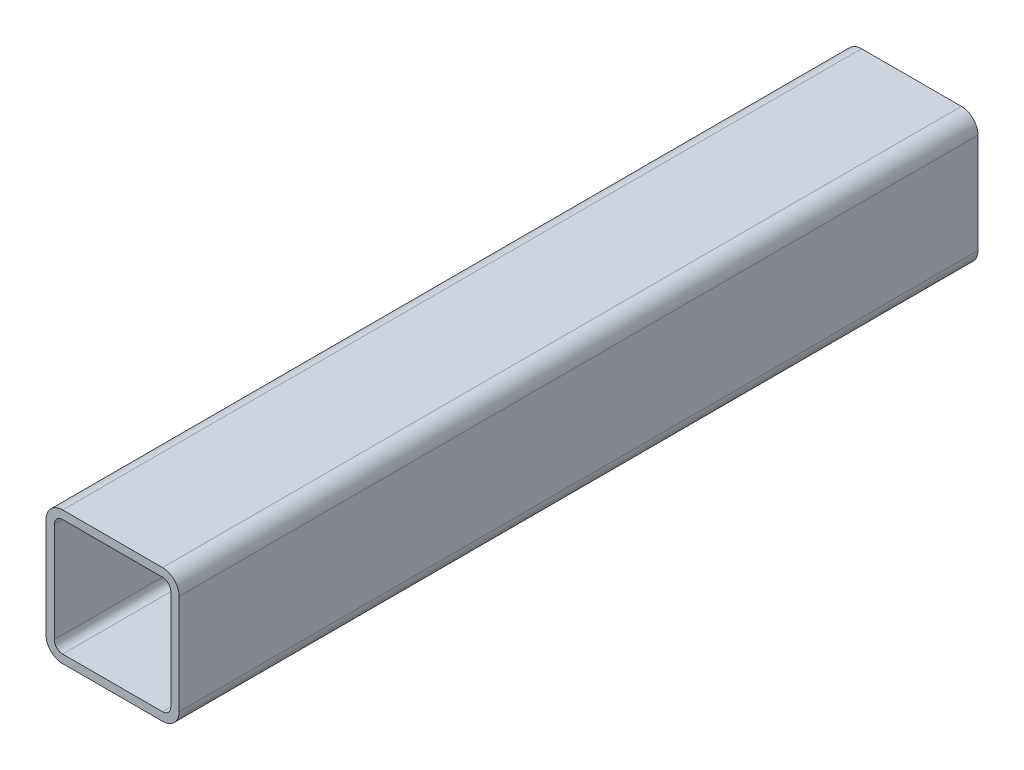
ISO-10303-21;
HEADER;
FILE_DESCRIPTION(('STEP AP214'),'2;1');
FILE_NAME('part.step','',(''),(''),'','','');
FILE_SCHEMA(('AUTOMOTIVE_DESIGN { 1 0 10303 214 1 1 1 1 }'));
ENDSEC;
DATA;
#1=APPLICATION_CONTEXT('core data for automotive mechanical design processes');
#2=APPLICATION_PROTOCOL_DEFINITION('international standard','automotive_design',2000,#1);
#3=PRODUCT_CONTEXT('',#1,'mechanical');
#4=PRODUCT('Part','Part','',(#3));
#5=PRODUCT_RELATED_PRODUCT_CATEGORY('part','',(#4));
#6=PRODUCT_DEFINITION_FORMATION('','',#4);
#7=PRODUCT_DEFINITION_CONTEXT('part definition',#1,'design');
#8=PRODUCT_DEFINITION('design','',#6,#7);
#9=PRODUCT_DEFINITION_SHAPE('','',#8);
#10=(LENGTH_UNIT() NAMED_UNIT(*) SI_UNIT(.MILLI.,.METRE.));
#11=(NAMED_UNIT(*) PLANE_ANGLE_UNIT() SI_UNIT($,.RADIAN.));
#12=(NAMED_UNIT(*) SI_UNIT($,.STERADIAN.) SOLID_ANGLE_UNIT());
#13=UNCERTAINTY_MEASURE_WITH_UNIT(LENGTH_MEASURE(1.E-05),#10,'distance_accuracy_value','');
#14=(GEOMETRIC_REPRESENTATION_CONTEXT(3) GLOBAL_UNCERTAINTY_ASSIGNED_CONTEXT((#13)) GLOBAL_UNIT_ASSIGNED_CONTEXT((#10,
#11,#12)) REPRESENTATION_CONTEXT('',''));
#15=CARTESIAN_POINT('',(0.,0.,0.));
#16=DIRECTION('',(0.,0.,1.));
#17=DIRECTION('',(1.,0.,0.));
#18=AXIS2_PLACEMENT_3D('',#15,#16,#17);
#19=CARTESIAN_POINT('',(6.34999999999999,44.45,304.8));
#20=DIRECTION('',(0.,0.,1.));
#21=DIRECTION('',(1.,0.,0.));
#22=AXIS2_PLACEMENT_3D('',#19,#20,#21);
#23=PLANE('',#22);
#24=CARTESIAN_POINT('',(6.34999999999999,44.45,304.8));
#25=DIRECTION('',(0.,0.,1.));
#26=DIRECTION('',(1.,0.,0.));
#27=AXIS2_PLACEMENT_3D('',#24,#25,#26);
#28=CIRCLE('',#27,6.35);
#29=CARTESIAN_POINT('',(6.35,50.8,304.8));
#30=VERTEX_POINT('',#29);
#31=CARTESIAN_POINT('',(0.,44.45,304.8));
#32=VERTEX_POINT('',#31);
#33=EDGE_CURVE('E211',#30,#32,#28,.T.);
#34=ORIENTED_EDGE('',*,*,#33,.T.);
#35=DIRECTION('',(0.,-1.,0.));
#36=VECTOR('',#35,1.);
#37=CARTESIAN_POINT('',(0.,6.35,304.8));
#38=LINE('',#37,#36);
#39=CARTESIAN_POINT('',(0.,6.35,304.8));
#40=VERTEX_POINT('',#39);
#41=EDGE_CURVE('E214',#32,#40,#38,.T.);
#42=ORIENTED_EDGE('',*,*,#41,.T.);
#43=CARTESIAN_POINT('',(6.35,6.35,304.8));
#44=DIRECTION('',(0.,0.,1.));
#45=DIRECTION('',(1.,0.,0.));
#46=AXIS2_PLACEMENT_3D('',#43,#44,#45);
#47=CIRCLE('',#46,6.35);
#48=CARTESIAN_POINT('',(6.35,0.,304.8));
#49=VERTEX_POINT('',#48);
#50=EDGE_CURVE('E217',#40,#49,#47,.T.);
#51=ORIENTED_EDGE('',*,*,#50,.T.);
#52=DIRECTION('',(1.,0.,0.));
#53=VECTOR('',#52,1.);
#54=CARTESIAN_POINT('',(44.45,0.,304.8));
#55=LINE('',#54,#53);
#56=CARTESIAN_POINT('',(44.45,0.,304.8));
#57=VERTEX_POINT('',#56);
#58=EDGE_CURVE('E219',#49,#57,#55,.T.);
#59=ORIENTED_EDGE('',*,*,#58,.T.);
#60=CARTESIAN_POINT('',(44.45,6.34999999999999,304.8));
#61=DIRECTION('',(0.,0.,1.));
#62=DIRECTION('',(1.,0.,0.));
#63=AXIS2_PLACEMENT_3D('',#60,#61,#62);
#64=CIRCLE('',#63,6.35);
#65=CARTESIAN_POINT('',(50.8,6.35,304.8));
#66=VERTEX_POINT('',#65);
#67=EDGE_CURVE('E221',#57,#66,#64,.T.);
#68=ORIENTED_EDGE('',*,*,#67,.T.);
#69=DIRECTION('',(0.,1.,0.));
#70=VECTOR('',#69,1.);
#71=CARTESIAN_POINT('',(50.8,44.45,304.8));
#72=LINE('',#71,#70);
#73=CARTESIAN_POINT('',(50.8,44.45,304.8));
#74=VERTEX_POINT('',#73);
#75=EDGE_CURVE('E223',#66,#74,#72,.T.);
#76=ORIENTED_EDGE('',*,*,#75,.T.);
#77=CARTESIAN_POINT('',(44.45,44.45,304.8));
#78=DIRECTION('',(0.,0.,1.));
#79=DIRECTION('',(1.,0.,0.));
#80=AXIS2_PLACEMENT_3D('',#77,#78,#79);
#81=CIRCLE('',#80,6.35);
#82=CARTESIAN_POINT('',(44.45,50.8,304.8));
#83=VERTEX_POINT('',#82);
#84=EDGE_CURVE('E225',#74,#83,#81,.T.);
#85=ORIENTED_EDGE('',*,*,#84,.T.);
#86=DIRECTION('',(-1.,0.,0.));
#87=VECTOR('',#86,1.);
#88=CARTESIAN_POINT('',(6.35,50.8,304.8));
#89=LINE('',#88,#87);
#90=EDGE_CURVE('E227',#83,#30,#89,.T.);
#91=ORIENTED_EDGE('',*,*,#90,.T.);
#92=EDGE_LOOP('',(#34,#42,#51,#59,#68,#76,#85,#91));
#93=FACE_BOUND('',#92,.T.);
#94=DIRECTION('',(0.,-1.,0.));
#95=VECTOR('',#94,1.);
#96=CARTESIAN_POINT('',(3.175,6.35,304.8));
#97=LINE('',#96,#95);
#98=CARTESIAN_POINT('',(3.175,44.45,304.8));
#99=VERTEX_POINT('',#98);
#100=CARTESIAN_POINT('',(3.175,6.35,304.8));
#101=VERTEX_POINT('',#100);
#102=EDGE_CURVE('E154',#99,#101,#97,.T.);
#103=ORIENTED_EDGE('',*,*,#102,.F.);
#104=CARTESIAN_POINT('',(6.34999999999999,44.45,304.8));
#105=DIRECTION('',(0.,0.,1.));
#106=DIRECTION('',(1.,0.,0.));
#107=AXIS2_PLACEMENT_3D('',#104,#105,#106);
#108=CIRCLE('',#107,3.175);
#109=CARTESIAN_POINT('',(6.35,47.625,304.8));
#110=VERTEX_POINT('',#109);
#111=EDGE_CURVE('E146',#110,#99,#108,.T.);
#112=ORIENTED_EDGE('',*,*,#111,.F.);
#113=DIRECTION('',(-1.,0.,0.));
#114=VECTOR('',#113,1.);
#115=CARTESIAN_POINT('',(6.35,47.625,304.8));
#116=LINE('',#115,#114);
#117=CARTESIAN_POINT('',(44.45,47.625,304.8));
#118=VERTEX_POINT('',#117);
#119=EDGE_CURVE('E179',#118,#110,#116,.T.);
#120=ORIENTED_EDGE('',*,*,#119,.F.);
#121=CARTESIAN_POINT('',(44.45,44.45,304.8));
#122=DIRECTION('',(0.,0.,1.));
#123=DIRECTION('',(1.,0.,0.));
#124=AXIS2_PLACEMENT_3D('',#121,#122,#123);
#125=CIRCLE('',#124,3.175);
#126=CARTESIAN_POINT('',(47.625,44.45,304.8));
#127=VERTEX_POINT('',#126);
#128=EDGE_CURVE('E177',#127,#118,#125,.T.);
#129=ORIENTED_EDGE('',*,*,#128,.F.);
#130=DIRECTION('',(0.,1.,0.));
#131=VECTOR('',#130,1.);
#132=CARTESIAN_POINT('',(47.625,44.45,304.8));
#133=LINE('',#132,#131);
#134=CARTESIAN_POINT('',(47.625,6.35,304.8));
#135=VERTEX_POINT('',#134);
#136=EDGE_CURVE('E175',#135,#127,#133,.T.);
#137=ORIENTED_EDGE('',*,*,#136,.F.);
#138=CARTESIAN_POINT('',(44.45,6.34999999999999,304.8));
#139=DIRECTION('',(0.,0.,1.));
#140=DIRECTION('',(1.,0.,0.));
#141=AXIS2_PLACEMENT_3D('',#138,#139,#140);
#142=CIRCLE('',#141,3.175);
#143=CARTESIAN_POINT('',(44.45,3.175,304.8));
#144=VERTEX_POINT('',#143);
#145=EDGE_CURVE('E173',#144,#135,#142,.T.);
#146=ORIENTED_EDGE('',*,*,#145,.F.);
#147=DIRECTION('',(1.,0.,0.));
#148=VECTOR('',#147,1.);
#149=CARTESIAN_POINT('',(44.45,3.175,304.8));
#150=LINE('',#149,#148);
#151=CARTESIAN_POINT('',(6.35,3.175,304.8));
#152=VERTEX_POINT('',#151);
#153=EDGE_CURVE('E169',#152,#144,#150,.T.);
#154=ORIENTED_EDGE('',*,*,#153,.F.);
#155=CARTESIAN_POINT('',(6.35,6.35,304.8));
#156=DIRECTION('',(0.,0.,1.));
#157=DIRECTION('',(1.,0.,0.));
#158=AXIS2_PLACEMENT_3D('',#155,#156,#157);
#159=CIRCLE('',#158,3.175);
#160=EDGE_CURVE('E167',#101,#152,#159,.T.);
#161=ORIENTED_EDGE('',*,*,#160,.F.);
#162=EDGE_LOOP('',(#103,#112,#120,#129,#137,#146,#154,#161));
#163=FACE_BOUND('',#162,.T.);
#164=ADVANCED_FACE('F33',(#93,#163),#23,.T.);
#165=CARTESIAN_POINT('',(6.34999999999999,44.45,0.));
#166=DIRECTION('',(0.,0.,1.));
#167=DIRECTION('',(1.,0.,0.));
#168=AXIS2_PLACEMENT_3D('',#165,#166,#167);
#169=PLANE('',#168);
#170=CARTESIAN_POINT('',(6.34999999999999,44.45,0.));
#171=DIRECTION('',(0.,0.,1.));
#172=DIRECTION('',(1.,0.,0.));
#173=AXIS2_PLACEMENT_3D('',#170,#171,#172);
#174=CIRCLE('',#173,6.35);
#175=CARTESIAN_POINT('',(6.35,50.8,0.));
#176=VERTEX_POINT('',#175);
#177=CARTESIAN_POINT('',(0.,44.45,0.));
#178=VERTEX_POINT('',#177);
#179=EDGE_CURVE('E162',#176,#178,#174,.T.);
#180=ORIENTED_EDGE('',*,*,#179,.F.);
#181=DIRECTION('',(-1.,0.,0.));
#182=VECTOR('',#181,1.);
#183=CARTESIAN_POINT('',(6.35,50.8,0.));
#184=LINE('',#183,#182);
#185=CARTESIAN_POINT('',(44.45,50.8,0.));
#186=VERTEX_POINT('',#185);
#187=EDGE_CURVE('E215',#186,#176,#184,.T.);
#188=ORIENTED_EDGE('',*,*,#187,.F.);
#189=CARTESIAN_POINT('',(44.45,44.45,0.));
#190=DIRECTION('',(0.,0.,1.));
#191=DIRECTION('',(1.,0.,0.));
#192=AXIS2_PLACEMENT_3D('',#189,#190,#191);
#193=CIRCLE('',#192,6.35);
#194=CARTESIAN_POINT('',(50.8,44.45,0.));
#195=VERTEX_POINT('',#194);
#196=EDGE_CURVE('E242',#195,#186,#193,.T.);
#197=ORIENTED_EDGE('',*,*,#196,.F.);
#198=DIRECTION('',(0.,1.,0.));
#199=VECTOR('',#198,1.);
#200=CARTESIAN_POINT('',(50.8,44.45,0.));
#201=LINE('',#200,#199);
#202=CARTESIAN_POINT('',(50.8,6.35,0.));
#203=VERTEX_POINT('',#202);
#204=EDGE_CURVE('E240',#203,#195,#201,.T.);
#205=ORIENTED_EDGE('',*,*,#204,.F.);
#206=CARTESIAN_POINT('',(44.45,6.34999999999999,0.));
#207=DIRECTION('',(0.,0.,1.));
#208=DIRECTION('',(1.,0.,0.));
#209=AXIS2_PLACEMENT_3D('',#206,#207,#208);
#210=CIRCLE('',#209,6.35);
#211=CARTESIAN_POINT('',(44.45,0.,0.));
#212=VERTEX_POINT('',#211);
#213=EDGE_CURVE('E238',#212,#203,#210,.T.);
#214=ORIENTED_EDGE('',*,*,#213,.F.);
#215=DIRECTION('',(1.,0.,0.));
#216=VECTOR('',#215,1.);
#217=CARTESIAN_POINT('',(44.45,0.,0.));
#218=LINE('',#217,#216);
#219=CARTESIAN_POINT('',(6.35,0.,0.));
#220=VERTEX_POINT('',#219);
#221=EDGE_CURVE('E236',#220,#212,#218,.T.);
#222=ORIENTED_EDGE('',*,*,#221,.F.);
#223=CARTESIAN_POINT('',(6.35,6.35,0.));
#224=DIRECTION('',(0.,0.,1.));
#225=DIRECTION('',(1.,0.,0.));
#226=AXIS2_PLACEMENT_3D('',#223,#224,#225);
#227=CIRCLE('',#226,6.35);
#228=CARTESIAN_POINT('',(0.,6.35,0.));
#229=VERTEX_POINT('',#228);
#230=EDGE_CURVE('E234',#229,#220,#227,.T.);
#231=ORIENTED_EDGE('',*,*,#230,.F.);
#232=DIRECTION('',(0.,-1.,0.));
#233=VECTOR('',#232,1.);
#234=CARTESIAN_POINT('',(0.,6.35,0.));
#235=LINE('',#234,#233);
#236=EDGE_CURVE('E232',#178,#229,#235,.T.);
#237=ORIENTED_EDGE('',*,*,#236,.F.);
#238=EDGE_LOOP('',(#180,#188,#197,#205,#214,#222,#231,#237));
#239=FACE_BOUND('',#238,.T.);
#240=CARTESIAN_POINT('',(6.34999999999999,44.45,0.));
#241=DIRECTION('',(0.,0.,1.));
#242=DIRECTION('',(1.,0.,0.));
#243=AXIS2_PLACEMENT_3D('',#240,#241,#242);
#244=CIRCLE('',#243,3.175);
#245=CARTESIAN_POINT('',(6.35,47.625,0.));
#246=VERTEX_POINT('',#245);
#247=CARTESIAN_POINT('',(3.175,44.45,0.));
#248=VERTEX_POINT('',#247);
#249=EDGE_CURVE('E56',#246,#248,#244,.T.);
#250=ORIENTED_EDGE('',*,*,#249,.T.);
#251=DIRECTION('',(0.,-1.,0.));
#252=VECTOR('',#251,1.);
#253=CARTESIAN_POINT('',(3.175,6.35,0.));
#254=LINE('',#253,#252);
#255=CARTESIAN_POINT('',(3.175,6.35,0.));
#256=VERTEX_POINT('',#255);
#257=EDGE_CURVE('E161',#248,#256,#254,.T.);
#258=ORIENTED_EDGE('',*,*,#257,.T.);
#259=CARTESIAN_POINT('',(6.35,6.35,0.));
#260=DIRECTION('',(0.,0.,1.));
#261=DIRECTION('',(1.,0.,0.));
#262=AXIS2_PLACEMENT_3D('',#259,#260,#261);
#263=CIRCLE('',#262,3.175);
#264=CARTESIAN_POINT('',(6.35,3.175,0.));
#265=VERTEX_POINT('',#264);
#266=EDGE_CURVE('E183',#256,#265,#263,.T.);
#267=ORIENTED_EDGE('',*,*,#266,.T.);
#268=DIRECTION('',(1.,0.,0.));
#269=VECTOR('',#268,1.);
#270=CARTESIAN_POINT('',(44.45,3.175,0.));
#271=LINE('',#270,#269);
#272=CARTESIAN_POINT('',(44.45,3.175,0.));
#273=VERTEX_POINT('',#272);
#274=EDGE_CURVE('E186',#265,#273,#271,.T.);
#275=ORIENTED_EDGE('',*,*,#274,.T.);
#276=CARTESIAN_POINT('',(44.45,6.34999999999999,0.));
#277=DIRECTION('',(0.,0.,1.));
#278=DIRECTION('',(1.,0.,0.));
#279=AXIS2_PLACEMENT_3D('',#276,#277,#278);
#280=CIRCLE('',#279,3.175);
#281=CARTESIAN_POINT('',(47.625,6.35,0.));
#282=VERTEX_POINT('',#281);
#283=EDGE_CURVE('E189',#273,#282,#280,.T.);
#284=ORIENTED_EDGE('',*,*,#283,.T.);
#285=DIRECTION('',(0.,1.,0.));
#286=VECTOR('',#285,1.);
#287=CARTESIAN_POINT('',(47.625,44.45,0.));
#288=LINE('',#287,#286);
#289=CARTESIAN_POINT('',(47.625,44.45,0.));
#290=VERTEX_POINT('',#289);
#291=EDGE_CURVE('E192',#282,#290,#288,.T.);
#292=ORIENTED_EDGE('',*,*,#291,.T.);
#293=CARTESIAN_POINT('',(44.45,44.45,0.));
#294=DIRECTION('',(0.,0.,1.));
#295=DIRECTION('',(1.,0.,0.));
#296=AXIS2_PLACEMENT_3D('',#293,#294,#295);
#297=CIRCLE('',#296,3.175);
#298=CARTESIAN_POINT('',(44.45,47.625,0.));
#299=VERTEX_POINT('',#298);
#300=EDGE_CURVE('E195',#290,#299,#297,.T.);
#301=ORIENTED_EDGE('',*,*,#300,.T.);
#302=DIRECTION('',(-1.,0.,0.));
#303=VECTOR('',#302,1.);
#304=CARTESIAN_POINT('',(6.35,47.625,0.));
#305=LINE('',#304,#303);
#306=EDGE_CURVE('E155',#299,#246,#305,.T.);
#307=ORIENTED_EDGE('',*,*,#306,.T.);
#308=EDGE_LOOP('',(#250,#258,#267,#275,#284,#292,#301,#307));
#309=FACE_BOUND('',#308,.T.);
#310=ADVANCED_FACE('F272',(#239,#309),#169,.F.);
#311=CARTESIAN_POINT('',(6.34999999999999,44.45,304.8));
#312=DIRECTION('',(0.,0.,-1.));
#313=DIRECTION('',(-1.,0.,0.));
#314=AXIS2_PLACEMENT_3D('',#311,#312,#313);
#315=CYLINDRICAL_SURFACE('',#314,6.35);
#316=ORIENTED_EDGE('',*,*,#179,.T.);
#317=DIRECTION('',(0.,0.,-1.));
#318=VECTOR('',#317,1.);
#319=CARTESIAN_POINT('',(0.,44.45,304.8));
#320=LINE('',#319,#318);
#321=EDGE_CURVE('E11',#32,#178,#320,.T.);
#322=ORIENTED_EDGE('',*,*,#321,.F.);
#323=ORIENTED_EDGE('',*,*,#33,.F.);
#324=DIRECTION('',(0.,0.,-1.));
#325=VECTOR('',#324,1.);
#326=CARTESIAN_POINT('',(6.35,50.8,304.8));
#327=LINE('',#326,#325);
#328=EDGE_CURVE('E229',#30,#176,#327,.T.);
#329=ORIENTED_EDGE('',*,*,#328,.T.);
#330=EDGE_LOOP('',(#316,#322,#323,#329));
#331=FACE_BOUND('',#330,.T.);
#332=ADVANCED_FACE('F35',(#331),#315,.T.);
#333=CARTESIAN_POINT('',(0.,6.35,304.8));
#334=DIRECTION('',(1.,0.,0.));
#335=DIRECTION('',(0.,0.,-1.));
#336=AXIS2_PLACEMENT_3D('',#333,#334,#335);
#337=PLANE('',#336);
#338=ORIENTED_EDGE('',*,*,#236,.T.);
#339=DIRECTION('',(0.,0.,-1.));
#340=VECTOR('',#339,1.);
#341=CARTESIAN_POINT('',(0.,6.35,304.8));
#342=LINE('',#341,#340);
#343=EDGE_CURVE('E41',#40,#229,#342,.T.);
#344=ORIENTED_EDGE('',*,*,#343,.F.);
#345=ORIENTED_EDGE('',*,*,#41,.F.);
#346=ORIENTED_EDGE('',*,*,#321,.T.);
#347=EDGE_LOOP('',(#338,#344,#345,#346));
#348=FACE_BOUND('',#347,.T.);
#349=ADVANCED_FACE('F289',(#348),#337,.F.);
#350=CARTESIAN_POINT('',(6.35,6.35,304.8));
#351=DIRECTION('',(0.,0.,-1.));
#352=DIRECTION('',(-1.,0.,0.));
#353=AXIS2_PLACEMENT_3D('',#350,#351,#352);
#354=CYLINDRICAL_SURFACE('',#353,6.35);
#355=ORIENTED_EDGE('',*,*,#230,.T.);
#356=DIRECTION('',(0.,0.,-1.));
#357=VECTOR('',#356,1.);
#358=CARTESIAN_POINT('',(6.35,0.,304.8));
#359=LINE('',#358,#357);
#360=EDGE_CURVE('E259',#49,#220,#359,.T.);
#361=ORIENTED_EDGE('',*,*,#360,.F.);
#362=ORIENTED_EDGE('',*,*,#50,.F.);
#363=ORIENTED_EDGE('',*,*,#343,.T.);
#364=EDGE_LOOP('',(#355,#361,#362,#363));
#365=FACE_BOUND('',#364,.T.);
#366=ADVANCED_FACE('F266',(#365),#354,.T.);
#367=CARTESIAN_POINT('',(44.45,0.,304.8));
#368=DIRECTION('',(0.,1.,0.));
#369=DIRECTION('',(0.,0.,1.));
#370=AXIS2_PLACEMENT_3D('',#367,#368,#369);
#371=PLANE('',#370);
#372=ORIENTED_EDGE('',*,*,#221,.T.);
#373=DIRECTION('',(0.,0.,-1.));
#374=VECTOR('',#373,1.);
#375=CARTESIAN_POINT('',(44.45,0.,304.8));
#376=LINE('',#375,#374);
#377=EDGE_CURVE('E256',#57,#212,#376,.T.);
#378=ORIENTED_EDGE('',*,*,#377,.F.);
#379=ORIENTED_EDGE('',*,*,#58,.F.);
#380=ORIENTED_EDGE('',*,*,#360,.T.);
#381=EDGE_LOOP('',(#372,#378,#379,#380));
#382=FACE_BOUND('',#381,.T.);
#383=ADVANCED_FACE('F278',(#382),#371,.F.);
#384=CARTESIAN_POINT('',(44.45,6.34999999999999,304.8));
#385=DIRECTION('',(0.,0.,-1.));
#386=DIRECTION('',(-1.,0.,0.));
#387=AXIS2_PLACEMENT_3D('',#384,#385,#386);
#388=CYLINDRICAL_SURFACE('',#387,6.35);
#389=ORIENTED_EDGE('',*,*,#213,.T.);
#390=DIRECTION('',(0.,0.,-1.));
#391=VECTOR('',#390,1.);
#392=CARTESIAN_POINT('',(50.8,6.35,304.8));
#393=LINE('',#392,#391);
#394=EDGE_CURVE('E253',#66,#203,#393,.T.);
#395=ORIENTED_EDGE('',*,*,#394,.F.);
#396=ORIENTED_EDGE('',*,*,#67,.F.);
#397=ORIENTED_EDGE('',*,*,#377,.T.);
#398=EDGE_LOOP('',(#389,#395,#396,#397));
#399=FACE_BOUND('',#398,.T.);
#400=ADVANCED_FACE('F282',(#399),#388,.T.);
#401=CARTESIAN_POINT('',(50.8,44.45,304.8));
#402=DIRECTION('',(-1.,0.,0.));
#403=DIRECTION('',(0.,0.,1.));
#404=AXIS2_PLACEMENT_3D('',#401,#402,#403);
#405=PLANE('',#404);
#406=ORIENTED_EDGE('',*,*,#204,.T.);
#407=DIRECTION('',(0.,0.,-1.));
#408=VECTOR('',#407,1.);
#409=CARTESIAN_POINT('',(50.8,44.45,304.8));
#410=LINE('',#409,#408);
#411=EDGE_CURVE('E250',#74,#195,#410,.T.);
#412=ORIENTED_EDGE('',*,*,#411,.F.);
#413=ORIENTED_EDGE('',*,*,#75,.F.);
#414=ORIENTED_EDGE('',*,*,#394,.T.);
#415=EDGE_LOOP('',(#406,#412,#413,#414));
#416=FACE_BOUND('',#415,.T.);
#417=ADVANCED_FACE('F302',(#416),#405,.F.);
#418=CARTESIAN_POINT('',(44.45,44.45,304.8));
#419=DIRECTION('',(0.,0.,-1.));
#420=DIRECTION('',(-1.,0.,0.));
#421=AXIS2_PLACEMENT_3D('',#418,#419,#420);
#422=CYLINDRICAL_SURFACE('',#421,6.35);
#423=ORIENTED_EDGE('',*,*,#196,.T.);
#424=DIRECTION('',(0.,0.,-1.));
#425=VECTOR('',#424,1.);
#426=CARTESIAN_POINT('',(44.45,50.8,304.8));
#427=LINE('',#426,#425);
#428=EDGE_CURVE('E247',#83,#186,#427,.T.);
#429=ORIENTED_EDGE('',*,*,#428,.F.);
#430=ORIENTED_EDGE('',*,*,#84,.F.);
#431=ORIENTED_EDGE('',*,*,#411,.T.);
#432=EDGE_LOOP('',(#423,#429,#430,#431));
#433=FACE_BOUND('',#432,.T.);
#434=ADVANCED_FACE('F300',(#433),#422,.T.);
#435=CARTESIAN_POINT('',(6.35,50.8,304.8));
#436=DIRECTION('',(0.,-1.,0.));
#437=DIRECTION('',(0.,0.,-1.));
#438=AXIS2_PLACEMENT_3D('',#435,#436,#437);
#439=PLANE('',#438);
#440=ORIENTED_EDGE('',*,*,#187,.T.);
#441=ORIENTED_EDGE('',*,*,#328,.F.);
#442=ORIENTED_EDGE('',*,*,#90,.F.);
#443=ORIENTED_EDGE('',*,*,#428,.T.);
#444=EDGE_LOOP('',(#440,#441,#442,#443));
#445=FACE_BOUND('',#444,.T.);
#446=ADVANCED_FACE('F295',(#445),#439,.F.);
#447=CARTESIAN_POINT('',(6.34999999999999,44.45,304.8));
#448=DIRECTION('',(0.,0.,-1.));
#449=DIRECTION('',(-1.,0.,0.));
#450=AXIS2_PLACEMENT_3D('',#447,#448,#449);
#451=CYLINDRICAL_SURFACE('',#450,3.175);
#452=ORIENTED_EDGE('',*,*,#249,.F.);
#453=DIRECTION('',(0.,0.,-1.));
#454=VECTOR('',#453,1.);
#455=CARTESIAN_POINT('',(6.35,47.625,304.8));
#456=LINE('',#455,#454);
#457=EDGE_CURVE('E150',#110,#246,#456,.T.);
#458=ORIENTED_EDGE('',*,*,#457,.F.);
#459=ORIENTED_EDGE('',*,*,#111,.T.);
#460=DIRECTION('',(0.,0.,-1.));
#461=VECTOR('',#460,1.);
#462=CARTESIAN_POINT('',(3.175,44.45,304.8));
#463=LINE('',#462,#461);
#464=EDGE_CURVE('E149',#99,#248,#463,.T.);
#465=ORIENTED_EDGE('',*,*,#464,.T.);
#466=EDGE_LOOP('',(#452,#458,#459,#465));
#467=FACE_BOUND('',#466,.T.);
#468=ADVANCED_FACE('F148',(#467),#451,.F.);
#469=CARTESIAN_POINT('',(3.175,6.35,304.8));
#470=DIRECTION('',(1.,0.,0.));
#471=DIRECTION('',(0.,0.,-1.));
#472=AXIS2_PLACEMENT_3D('',#469,#470,#471);
#473=PLANE('',#472);
#474=ORIENTED_EDGE('',*,*,#257,.F.);
#475=ORIENTED_EDGE('',*,*,#464,.F.);
#476=ORIENTED_EDGE('',*,*,#102,.T.);
#477=DIRECTION('',(0.,0.,-1.));
#478=VECTOR('',#477,1.);
#479=CARTESIAN_POINT('',(3.175,6.35,304.8));
#480=LINE('',#479,#478);
#481=EDGE_CURVE('E163',#101,#256,#480,.T.);
#482=ORIENTED_EDGE('',*,*,#481,.T.);
#483=EDGE_LOOP('',(#474,#475,#476,#482));
#484=FACE_BOUND('',#483,.T.);
#485=ADVANCED_FACE('F158',(#484),#473,.T.);
#486=CARTESIAN_POINT('',(6.35,6.35,304.8));
#487=DIRECTION('',(0.,0.,-1.));
#488=DIRECTION('',(-1.,0.,0.));
#489=AXIS2_PLACEMENT_3D('',#486,#487,#488);
#490=CYLINDRICAL_SURFACE('',#489,3.175);
#491=ORIENTED_EDGE('',*,*,#266,.F.);
#492=ORIENTED_EDGE('',*,*,#481,.F.);
#493=ORIENTED_EDGE('',*,*,#160,.T.);
#494=DIRECTION('',(0.,0.,-1.));
#495=VECTOR('',#494,1.);
#496=CARTESIAN_POINT('',(6.35,3.175,304.8));
#497=LINE('',#496,#495);
#498=EDGE_CURVE('E208',#152,#265,#497,.T.);
#499=ORIENTED_EDGE('',*,*,#498,.T.);
#500=EDGE_LOOP('',(#491,#492,#493,#499));
#501=FACE_BOUND('',#500,.T.);
#502=ADVANCED_FACE('F327',(#501),#490,.F.);
#503=CARTESIAN_POINT('',(44.45,3.175,304.8));
#504=DIRECTION('',(0.,1.,0.));
#505=DIRECTION('',(0.,0.,1.));
#506=AXIS2_PLACEMENT_3D('',#503,#504,#505);
#507=PLANE('',#506);
#508=ORIENTED_EDGE('',*,*,#274,.F.);
#509=ORIENTED_EDGE('',*,*,#498,.F.);
#510=ORIENTED_EDGE('',*,*,#153,.T.);
#511=DIRECTION('',(0.,0.,-1.));
#512=VECTOR('',#511,1.);
#513=CARTESIAN_POINT('',(44.45,3.175,304.8));
#514=LINE('',#513,#512);
#515=EDGE_CURVE('E206',#144,#273,#514,.T.);
#516=ORIENTED_EDGE('',*,*,#515,.T.);
#517=EDGE_LOOP('',(#508,#509,#510,#516));
#518=FACE_BOUND('',#517,.T.);
#519=ADVANCED_FACE('F331',(#518),#507,.T.);
#520=CARTESIAN_POINT('',(44.45,6.34999999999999,304.8));
#521=DIRECTION('',(0.,0.,-1.));
#522=DIRECTION('',(-1.,0.,0.));
#523=AXIS2_PLACEMENT_3D('',#520,#521,#522);
#524=CYLINDRICAL_SURFACE('',#523,3.175);
#525=ORIENTED_EDGE('',*,*,#283,.F.);
#526=ORIENTED_EDGE('',*,*,#515,.F.);
#527=ORIENTED_EDGE('',*,*,#145,.T.);
#528=DIRECTION('',(0.,0.,-1.));
#529=VECTOR('',#528,1.);
#530=CARTESIAN_POINT('',(47.625,6.35,304.8));
#531=LINE('',#530,#529);
#532=EDGE_CURVE('E204',#135,#282,#531,.T.);
#533=ORIENTED_EDGE('',*,*,#532,.T.);
#534=EDGE_LOOP('',(#525,#526,#527,#533));
#535=FACE_BOUND('',#534,.T.);
#536=ADVANCED_FACE('F337',(#535),#524,.F.);
#537=CARTESIAN_POINT('',(47.625,44.45,304.8));
#538=DIRECTION('',(-1.,0.,0.));
#539=DIRECTION('',(0.,0.,1.));
#540=AXIS2_PLACEMENT_3D('',#537,#538,#539);
#541=PLANE('',#540);
#542=ORIENTED_EDGE('',*,*,#291,.F.);
#543=ORIENTED_EDGE('',*,*,#532,.F.);
#544=ORIENTED_EDGE('',*,*,#136,.T.);
#545=DIRECTION('',(0.,0.,-1.));
#546=VECTOR('',#545,1.);
#547=CARTESIAN_POINT('',(47.625,44.45,304.8));
#548=LINE('',#547,#546);
#549=EDGE_CURVE('E202',#127,#290,#548,.T.);
#550=ORIENTED_EDGE('',*,*,#549,.T.);
#551=EDGE_LOOP('',(#542,#543,#544,#550));
#552=FACE_BOUND('',#551,.T.);
#553=ADVANCED_FACE('F341',(#552),#541,.T.);
#554=CARTESIAN_POINT('',(44.45,44.45,304.8));
#555=DIRECTION('',(0.,0.,-1.));
#556=DIRECTION('',(-1.,0.,0.));
#557=AXIS2_PLACEMENT_3D('',#554,#555,#556);
#558=CYLINDRICAL_SURFACE('',#557,3.175);
#559=ORIENTED_EDGE('',*,*,#300,.F.);
#560=ORIENTED_EDGE('',*,*,#549,.F.);
#561=ORIENTED_EDGE('',*,*,#128,.T.);
#562=DIRECTION('',(0.,0.,-1.));
#563=VECTOR('',#562,1.);
#564=CARTESIAN_POINT('',(44.45,47.625,304.8));
#565=LINE('',#564,#563);
#566=EDGE_CURVE('E48',#118,#299,#565,.T.);
#567=ORIENTED_EDGE('',*,*,#566,.T.);
#568=EDGE_LOOP('',(#559,#560,#561,#567));
#569=FACE_BOUND('',#568,.T.);
#570=ADVANCED_FACE('F345',(#569),#558,.F.);
#571=CARTESIAN_POINT('',(6.35,47.625,304.8));
#572=DIRECTION('',(0.,-1.,0.));
#573=DIRECTION('',(0.,0.,-1.));
#574=AXIS2_PLACEMENT_3D('',#571,#572,#573);
#575=PLANE('',#574);
#576=ORIENTED_EDGE('',*,*,#306,.F.);
#577=ORIENTED_EDGE('',*,*,#566,.F.);
#578=ORIENTED_EDGE('',*,*,#119,.T.);
#579=ORIENTED_EDGE('',*,*,#457,.T.);
#580=EDGE_LOOP('',(#576,#577,#578,#579));
#581=FACE_BOUND('',#580,.T.);
#582=ADVANCED_FACE('F349',(#581),#575,.T.);
#583=CLOSED_SHELL('',(#164,#310,#332,#349,#366,#383,#400,#417,#434,#446,#468,#485,#502,#519,
#536,#553,#570,#582));
#584=MANIFOLD_SOLID_BREP('B2',#583);
#585=ADVANCED_BREP_SHAPE_REPRESENTATION('',(#18,#584),#14);
#586=SHAPE_DEFINITION_REPRESENTATION(#9,#585);
ENDSEC;
END-ISO-10303-21;
